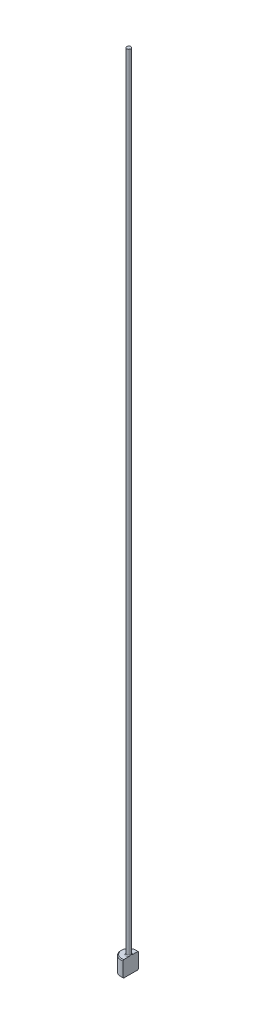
ISO-10303-21;
HEADER;
FILE_DESCRIPTION(('STEP AP214'),'2;1');
FILE_NAME('part.step','',(''),(''),'','','');
FILE_SCHEMA(('AUTOMOTIVE_DESIGN { 1 0 10303 214 1 1 1 1 }'));
ENDSEC;
DATA;
#1=APPLICATION_CONTEXT('core data for automotive mechanical design processes');
#2=APPLICATION_PROTOCOL_DEFINITION('international standard','automotive_design',2000,#1);
#3=PRODUCT_CONTEXT('',#1,'mechanical');
#4=PRODUCT('Part','Part','',(#3));
#5=PRODUCT_RELATED_PRODUCT_CATEGORY('part','',(#4));
#6=PRODUCT_DEFINITION_FORMATION('','',#4);
#7=PRODUCT_DEFINITION_CONTEXT('part definition',#1,'design');
#8=PRODUCT_DEFINITION('design','',#6,#7);
#9=PRODUCT_DEFINITION_SHAPE('','',#8);
#10=(LENGTH_UNIT() NAMED_UNIT(*) SI_UNIT(.MILLI.,.METRE.));
#11=(NAMED_UNIT(*) PLANE_ANGLE_UNIT() SI_UNIT($,.RADIAN.));
#12=(NAMED_UNIT(*) SI_UNIT($,.STERADIAN.) SOLID_ANGLE_UNIT());
#13=UNCERTAINTY_MEASURE_WITH_UNIT(LENGTH_MEASURE(1.E-05),#10,'distance_accuracy_value','');
#14=(GEOMETRIC_REPRESENTATION_CONTEXT(3) GLOBAL_UNCERTAINTY_ASSIGNED_CONTEXT((#13)) GLOBAL_UNIT_ASSIGNED_CONTEXT((#10,
#11,#12)) REPRESENTATION_CONTEXT('',''));
#15=CARTESIAN_POINT('',(0.,0.,0.));
#16=DIRECTION('',(0.,0.,1.));
#17=DIRECTION('',(1.,0.,0.));
#18=AXIS2_PLACEMENT_3D('',#15,#16,#17);
#19=CARTESIAN_POINT('',(0.,0.,0.));
#20=DIRECTION('',(0.,-1.,0.));
#21=DIRECTION('',(0.,0.,-1.));
#22=AXIS2_PLACEMENT_3D('',#19,#20,#21);
#23=PLANE('',#22);
#24=CARTESIAN_POINT('',(0.,0.,0.));
#25=DIRECTION('',(0.,-1.,0.));
#26=DIRECTION('',(0.,0.,-1.));
#27=AXIS2_PLACEMENT_3D('',#24,#25,#26);
#28=CIRCLE('',#27,1.8);
#29=CARTESIAN_POINT('',(0.499999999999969,0.,1.72916164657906));
#30=VERTEX_POINT('',#29);
#31=CARTESIAN_POINT('',(0.499999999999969,0.,-1.72916164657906));
#32=VERTEX_POINT('',#31);
#33=EDGE_CURVE('E98',#30,#32,#28,.T.);
#34=ORIENTED_EDGE('',*,*,#33,.T.);
#35=DIRECTION('',(0.,0.,1.));
#36=VECTOR('',#35,1.);
#37=CARTESIAN_POINT('',(0.499999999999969,0.,1.93649167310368));
#38=LINE('',#37,#36);
#39=EDGE_CURVE('E83',#32,#30,#38,.T.);
#40=ORIENTED_EDGE('',*,*,#39,.T.);
#41=EDGE_LOOP('',(#34,#40));
#42=FACE_BOUND('',#41,.T.);
#43=ADVANCED_FACE('F32',(#42),#23,.T.);
#44=CARTESIAN_POINT('',(0.,259.958771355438,0.));
#45=DIRECTION('',(0.,1.,0.));
#46=DIRECTION('',(0.,0.,1.));
#47=AXIS2_PLACEMENT_3D('',#44,#45,#46);
#48=CYLINDRICAL_SURFACE('',#47,1.99999999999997);
#49=CARTESIAN_POINT('',(0.,3.79999999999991,0.));
#50=DIRECTION('',(0.,1.,0.));
#51=DIRECTION('',(0.,0.,1.));
#52=AXIS2_PLACEMENT_3D('',#49,#50,#51);
#53=CIRCLE('',#52,1.99999999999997);
#54=CARTESIAN_POINT('',(0.499999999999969,3.79999999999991,1.93649167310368));
#55=VERTEX_POINT('',#54);
#56=CARTESIAN_POINT('',(0.499999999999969,3.79999999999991,-1.93649167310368));
#57=VERTEX_POINT('',#56);
#58=EDGE_CURVE('E104',#55,#57,#53,.F.);
#59=ORIENTED_EDGE('',*,*,#58,.T.);
#60=DIRECTION('',(0.,-1.,0.));
#61=VECTOR('',#60,1.);
#62=CARTESIAN_POINT('',(0.499999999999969,200.,-1.93649167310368));
#63=LINE('',#62,#61);
#64=CARTESIAN_POINT('',(0.499999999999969,0.199999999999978,-1.93649167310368));
#65=VERTEX_POINT('',#64);
#66=EDGE_CURVE('E183',#57,#65,#63,.T.);
#67=ORIENTED_EDGE('',*,*,#66,.T.);
#68=CARTESIAN_POINT('',(0.,0.199999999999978,0.));
#69=DIRECTION('',(0.,-1.,0.));
#70=DIRECTION('',(0.,0.,-1.));
#71=AXIS2_PLACEMENT_3D('',#68,#69,#70);
#72=CIRCLE('',#71,1.99999999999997);
#73=CARTESIAN_POINT('',(0.499999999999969,0.199999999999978,1.93649167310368));
#74=VERTEX_POINT('',#73);
#75=EDGE_CURVE('E100',#65,#74,#72,.F.);
#76=ORIENTED_EDGE('',*,*,#75,.T.);
#77=DIRECTION('',(0.,-1.,0.));
#78=VECTOR('',#77,1.);
#79=CARTESIAN_POINT('',(0.499999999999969,200.,1.93649167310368));
#80=LINE('',#79,#78);
#81=EDGE_CURVE('E93',#55,#74,#80,.T.);
#82=ORIENTED_EDGE('',*,*,#81,.F.);
#83=EDGE_LOOP('',(#59,#67,#76,#82));
#84=FACE_BOUND('',#83,.T.);
#85=ADVANCED_FACE('F158',(#84),#48,.T.);
#86=CARTESIAN_POINT('',(-1.99999999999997,4.,0.));
#87=DIRECTION('',(0.,1.,0.));
#88=DIRECTION('',(0.,0.,1.));
#89=AXIS2_PLACEMENT_3D('',#86,#87,#88);
#90=PLANE('',#89);
#91=CARTESIAN_POINT('',(0.,4.,0.));
#92=DIRECTION('',(0.,1.,0.));
#93=DIRECTION('',(0.,0.,1.));
#94=AXIS2_PLACEMENT_3D('',#91,#92,#93);
#95=CIRCLE('',#94,1.79999999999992);
#96=CARTESIAN_POINT('',(0.499999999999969,4.,-1.72916164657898));
#97=VERTEX_POINT('',#96);
#98=CARTESIAN_POINT('',(0.499999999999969,4.,1.72916164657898));
#99=VERTEX_POINT('',#98);
#100=EDGE_CURVE('E178',#97,#99,#95,.T.);
#101=ORIENTED_EDGE('',*,*,#100,.T.);
#102=DIRECTION('',(0.,0.,-1.));
#103=VECTOR('',#102,1.);
#104=CARTESIAN_POINT('',(0.499999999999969,4.,0.));
#105=LINE('',#104,#103);
#106=CARTESIAN_POINT('',(0.499999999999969,3.99999999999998,0.489897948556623));
#107=VERTEX_POINT('',#106);
#108=EDGE_CURVE('E57',#99,#107,#105,.T.);
#109=ORIENTED_EDGE('',*,*,#108,.T.);
#110=CARTESIAN_POINT('',(0.,4.,0.));
#111=DIRECTION('',(0.,1.,0.));
#112=DIRECTION('',(0.,0.,1.));
#113=AXIS2_PLACEMENT_3D('',#110,#111,#112);
#114=CIRCLE('',#113,0.699999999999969);
#115=CARTESIAN_POINT('',(0.499999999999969,3.99999999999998,-0.489897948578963));
#116=VERTEX_POINT('',#115);
#117=EDGE_CURVE('E107',#107,#116,#114,.F.);
#118=ORIENTED_EDGE('',*,*,#117,.T.);
#119=EDGE_CURVE('E136',#116,#97,#105,.T.);
#120=ORIENTED_EDGE('',*,*,#119,.T.);
#121=EDGE_LOOP('',(#101,#109,#118,#120));
#122=FACE_BOUND('',#121,.T.);
#123=ADVANCED_FACE('F147',(#122),#90,.T.);
#124=CARTESIAN_POINT('',(0.,4.,0.));
#125=DIRECTION('',(0.,-1.,0.));
#126=DIRECTION('',(0.,0.,-1.));
#127=AXIS2_PLACEMENT_3D('',#124,#125,#126);
#128=CONICAL_SURFACE('',#127,1.79999999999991,0.785398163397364);
#129=ORIENTED_EDGE('',*,*,#58,.F.);
#130=CARTESIAN_POINT('',(0.499999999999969,1.50720401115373,4.26357800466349));
#131=CARTESIAN_POINT('',(0.499999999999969,1.62013826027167,4.14986755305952));
#132=CARTESIAN_POINT('',(0.499999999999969,1.7330438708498,4.03612863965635));
#133=CARTESIAN_POINT('',(0.499999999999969,1.95879795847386,3.80854889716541));
#134=CARTESIAN_POINT('',(0.499999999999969,2.07164641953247,3.6947080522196));
#135=CARTESIAN_POINT('',(0.499999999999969,2.29770695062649,3.46645461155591));
#136=CARTESIAN_POINT('',(0.499999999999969,2.41091859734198,3.352041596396));
#137=CARTESIAN_POINT('',(0.499999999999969,2.63717793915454,3.12309847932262));
#138=CARTESIAN_POINT('',(0.499999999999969,2.7502256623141,3.0085684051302));
#139=CARTESIAN_POINT('',(0.499999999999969,3.04506948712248,2.70936514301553));
#140=CARTESIAN_POINT('',(0.499999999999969,3.22671512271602,2.52454334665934));
#141=CARTESIAN_POINT('',(0.499999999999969,3.4985530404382,2.2465579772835));
#142=CARTESIAN_POINT('',(0.499999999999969,3.58909436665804,2.15373585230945));
#143=CARTESIAN_POINT('',(0.499999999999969,3.76982478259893,1.96776469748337));
#144=CARTESIAN_POINT('',(0.499999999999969,3.8600139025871,1.87461569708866));
#145=CARTESIAN_POINT('',(0.499999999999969,4.03950849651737,1.68818299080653));
#146=CARTESIAN_POINT('',(0.499999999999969,4.12881605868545,1.59490129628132));
#147=CARTESIAN_POINT('',(0.499999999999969,4.30662189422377,1.40750656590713));
#148=CARTESIAN_POINT('',(0.499999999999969,4.395119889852,1.31339326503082));
#149=CARTESIAN_POINT('',(0.499999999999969,4.52664527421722,1.17121612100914));
#150=CARTESIAN_POINT('',(0.499999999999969,4.57025302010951,1.12368988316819));
#151=CARTESIAN_POINT('',(0.499999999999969,4.65691222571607,1.02813370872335));
#152=CARTESIAN_POINT('',(0.499999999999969,4.69996370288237,0.980103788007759));
#153=CARTESIAN_POINT('',(0.499999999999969,4.78522208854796,0.883344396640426));
#154=CARTESIAN_POINT('',(0.499999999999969,4.82742943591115,0.834615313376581));
#155=CARTESIAN_POINT('',(0.499999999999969,4.91056132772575,0.736078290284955));
#156=CARTESIAN_POINT('',(0.499999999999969,4.95148615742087,0.686270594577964));
#157=CARTESIAN_POINT('',(0.499999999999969,5.00615923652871,0.616697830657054));
#158=CARTESIAN_POINT('',(0.499999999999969,5.02085639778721,0.59767965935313));
#159=CARTESIAN_POINT('',(0.499999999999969,5.04986049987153,0.559345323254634));
#160=CARTESIAN_POINT('',(0.499999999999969,5.06416741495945,0.540029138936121));
#161=CARTESIAN_POINT('',(0.499999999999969,5.09232483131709,0.500987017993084));
#162=CARTESIAN_POINT('',(0.499999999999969,5.10617402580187,0.481260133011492));
#163=CARTESIAN_POINT('',(0.499999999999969,5.13322286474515,0.441366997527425));
#164=CARTESIAN_POINT('',(0.499999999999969,5.14642252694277,0.421200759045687));
#165=CARTESIAN_POINT('',(0.499999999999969,5.18389185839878,0.36131795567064));
#166=CARTESIAN_POINT('',(0.499999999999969,5.20702995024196,0.320875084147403));
#167=CARTESIAN_POINT('',(0.499999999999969,5.24772098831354,0.237332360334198));
#168=CARTESIAN_POINT('',(0.499999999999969,5.26530335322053,0.194247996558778));
#169=CARTESIAN_POINT('',(0.499999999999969,5.28633621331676,0.120860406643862));
#170=CARTESIAN_POINT('',(0.499999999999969,5.29258236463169,0.0913941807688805));
#171=CARTESIAN_POINT('',(0.499999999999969,5.29984670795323,0.0318909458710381));
#172=CARTESIAN_POINT('',(0.499999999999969,5.30088385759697,0.00185640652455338));
#173=CARTESIAN_POINT('',(0.499999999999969,5.29754901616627,-0.0578626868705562));
#174=CARTESIAN_POINT('',(0.499999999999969,5.29318196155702,-0.0875475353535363));
#175=CARTESIAN_POINT('',(0.499999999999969,5.27991452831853,-0.145970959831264));
#176=CARTESIAN_POINT('',(0.499999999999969,5.27099331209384,-0.174704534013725));
#177=CARTESIAN_POINT('',(0.499999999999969,5.24698060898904,-0.238616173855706));
#178=CARTESIAN_POINT('',(0.499999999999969,5.23086745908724,-0.273397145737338));
#179=CARTESIAN_POINT('',(0.499999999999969,5.19533548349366,-0.341256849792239));
#180=CARTESIAN_POINT('',(0.499999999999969,5.17590893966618,-0.374331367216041));
#181=CARTESIAN_POINT('',(0.499999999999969,5.13484403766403,-0.439399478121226));
#182=CARTESIAN_POINT('',(0.499999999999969,5.11319038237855,-0.471383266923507));
#183=CARTESIAN_POINT('',(0.499999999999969,5.06854590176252,-0.534336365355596));
#184=CARTESIAN_POINT('',(0.499999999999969,5.04555662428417,-0.565306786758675));
#185=CARTESIAN_POINT('',(0.499999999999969,4.99582113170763,-0.630230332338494));
#186=CARTESIAN_POINT('',(0.499999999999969,4.96895642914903,-0.664092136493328));
#187=CARTESIAN_POINT('',(0.499999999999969,4.91443104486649,-0.731170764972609));
#188=CARTESIAN_POINT('',(0.499999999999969,4.88677027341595,-0.764387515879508));
#189=CARTESIAN_POINT('',(0.499999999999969,4.80293478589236,-0.863356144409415));
#190=CARTESIAN_POINT('',(0.499999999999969,4.74592734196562,-0.928400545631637));
#191=CARTESIAN_POINT('',(0.499999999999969,4.63061293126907,-1.05749298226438));
#192=CARTESIAN_POINT('',(0.499999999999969,4.57230411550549,-1.12153934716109));
#193=CARTESIAN_POINT('',(0.499999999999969,4.45494129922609,-1.24891760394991));
#194=CARTESIAN_POINT('',(0.499999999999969,4.39588747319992,-1.31224965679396));
#195=CARTESIAN_POINT('',(0.499999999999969,4.27755243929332,-1.43816012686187));
#196=CARTESIAN_POINT('',(0.499999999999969,4.21827347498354,-1.5007406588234));
#197=CARTESIAN_POINT('',(0.499999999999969,4.09936903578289,-1.62557837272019));
#198=CARTESIAN_POINT('',(0.499999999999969,4.03974354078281,-1.68783553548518));
#199=CARTESIAN_POINT('',(0.499999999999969,3.86059814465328,-1.87415457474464));
#200=CARTESIAN_POINT('',(0.499999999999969,3.74071340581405,-1.99786534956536));
#201=CARTESIAN_POINT('',(0.499999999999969,3.44590639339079,-2.30074922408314));
#202=CARTESIAN_POINT('',(0.499999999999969,3.27068324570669,-2.47962880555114));
#203=CARTESIAN_POINT('',(0.499999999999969,2.91959588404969,-2.8368625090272));
#204=CARTESIAN_POINT('',(0.499999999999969,2.74373149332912,-3.0152164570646));
#205=CARTESIAN_POINT('',(0.499999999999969,2.39118783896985,-3.37205745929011));
#206=CARTESIAN_POINT('',(0.499999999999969,2.21450765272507,-3.55054360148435));
#207=CARTESIAN_POINT('',(0.499999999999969,1.86097190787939,-3.90723139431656));
#208=CARTESIAN_POINT('',(0.499999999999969,1.6841164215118,-4.08543311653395));
#209=CARTESIAN_POINT('',(0.499999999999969,1.50720401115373,-4.2635780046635));
#210=B_SPLINE_CURVE_WITH_KNOTS('',3,(#130,#131,#132,#133,#134,#135,#136,#137,#138,#139,#140,
#141,#142,#143,#144,#145,#146,#147,#148,#149,#150,#151,#152,#153,#154,#155,#156,#157,#158,#159,
#160,#161,#162,#163,#164,#165,#166,#167,#168,#169,#170,#171,#172,#173,#174,#175,#176,#177,#178,
#179,#180,#181,#182,#183,#184,#185,#186,#187,#188,#189,#190,#191,#192,#193,#194,#195,#196,#197,
#198,#199,#200,#201,#202,#203,#204,#205,#206,#207,#208,#209),.UNSPECIFIED.,.F.,.F.,(4,2,2,2,2,2,
2,2,2,2,2,2,2,2,2,2,2,2,2,2,2,2,2,2,2,2,2,2,2,2,2,2,2,2,2,2,2,2,2,4),(0.,0.48078884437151,
0.961674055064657,1.44454547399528,1.92732112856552,2.70474283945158,3.09374505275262,
3.48271306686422,3.87013311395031,4.257681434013,4.45118175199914,4.64467598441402,
4.83806685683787,5.03141440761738,5.10351649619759,5.17562332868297,5.24792081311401,
5.32021632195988,5.45980182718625,5.59863530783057,5.68861811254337,5.77827319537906,
5.86784644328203,5.9578332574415,6.07253133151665,6.18750032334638,6.30331969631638,
6.41900742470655,6.54866226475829,6.67833177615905,6.93776961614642,7.19760305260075,
7.4573767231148,7.71597304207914,7.97458452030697,8.4913888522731,9.24259169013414,
9.99402016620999,10.747451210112,11.5006463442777),.UNSPECIFIED.);
#211=EDGE_CURVE('E135',#55,#99,#210,.T.);
#212=ORIENTED_EDGE('',*,*,#211,.T.);
#213=ORIENTED_EDGE('',*,*,#100,.F.);
#214=EDGE_CURVE('E127',#97,#57,#210,.T.);
#215=ORIENTED_EDGE('',*,*,#214,.T.);
#216=EDGE_LOOP('',(#129,#212,#213,#215));
#217=FACE_BOUND('',#216,.T.);
#218=ADVANCED_FACE('F143',(#217),#128,.T.);
#219=CARTESIAN_POINT('',(0.,0.199999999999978,0.));
#220=DIRECTION('',(0.,1.,0.));
#221=DIRECTION('',(0.,0.,1.));
#222=AXIS2_PLACEMENT_3D('',#219,#220,#221);
#223=CONICAL_SURFACE('',#222,1.99999999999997,0.785398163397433);
#224=ORIENTED_EDGE('',*,*,#75,.F.);
#225=CARTESIAN_POINT('',(0.499999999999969,2.49279598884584,-4.26357800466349));
#226=CARTESIAN_POINT('',(0.499999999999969,2.37986173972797,-4.14986755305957));
#227=CARTESIAN_POINT('',(0.499999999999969,2.26695612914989,-4.03612863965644));
#228=CARTESIAN_POINT('',(0.499999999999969,2.04120204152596,-3.80854889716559));
#229=CARTESIAN_POINT('',(0.499999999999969,1.92835358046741,-3.69470805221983));
#230=CARTESIAN_POINT('',(0.499999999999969,1.70229304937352,-3.46645461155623));
#231=CARTESIAN_POINT('',(0.499999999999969,1.58908140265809,-3.35204159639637));
#232=CARTESIAN_POINT('',(0.499999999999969,1.36282206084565,-3.12309847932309));
#233=CARTESIAN_POINT('',(0.499999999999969,1.24977433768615,-3.00856840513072));
#234=CARTESIAN_POINT('',(0.499999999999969,0.9549305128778,-2.70936514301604));
#235=CARTESIAN_POINT('',(0.499999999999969,0.773284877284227,-2.52454334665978));
#236=CARTESIAN_POINT('',(0.499999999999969,0.501446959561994,-2.24655797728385));
#237=CARTESIAN_POINT('',(0.499999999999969,0.410905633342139,-2.15373585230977));
#238=CARTESIAN_POINT('',(0.499999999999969,0.230175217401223,-1.96776469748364));
#239=CARTESIAN_POINT('',(0.499999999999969,0.139986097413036,-1.8746156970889));
#240=CARTESIAN_POINT('',(0.499999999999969,-0.0395084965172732,-1.68818299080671));
#241=CARTESIAN_POINT('',(0.499999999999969,-0.128816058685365,-1.59490129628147));
#242=CARTESIAN_POINT('',(0.499999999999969,-0.306621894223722,-1.40750656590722));
#243=CARTESIAN_POINT('',(0.499999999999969,-0.395119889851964,-1.31339326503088));
#244=CARTESIAN_POINT('',(0.499999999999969,-0.526645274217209,-1.17121612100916));
#245=CARTESIAN_POINT('',(0.499999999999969,-0.570253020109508,-1.12368988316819));
#246=CARTESIAN_POINT('',(0.499999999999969,-0.656912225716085,-1.02813370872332));
#247=CARTESIAN_POINT('',(0.499999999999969,-0.699963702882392,-0.980103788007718));
#248=CARTESIAN_POINT('',(0.499999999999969,-0.785222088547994,-0.883344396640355));
#249=CARTESIAN_POINT('',(0.499999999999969,-0.827429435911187,-0.834615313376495));
#250=CARTESIAN_POINT('',(0.499999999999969,-0.910561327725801,-0.736078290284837));
#251=CARTESIAN_POINT('',(0.499999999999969,-0.951486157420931,-0.68627059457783));
#252=CARTESIAN_POINT('',(0.499999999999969,-1.00615923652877,-0.616697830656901));
#253=CARTESIAN_POINT('',(0.499999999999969,-1.02085639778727,-0.597679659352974));
#254=CARTESIAN_POINT('',(0.499999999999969,-1.04986049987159,-0.559345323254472));
#255=CARTESIAN_POINT('',(0.499999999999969,-1.06416741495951,-0.540029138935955));
#256=CARTESIAN_POINT('',(0.499999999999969,-1.09232483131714,-0.500987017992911));
#257=CARTESIAN_POINT('',(0.499999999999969,-1.10617402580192,-0.481260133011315));
#258=CARTESIAN_POINT('',(0.499999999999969,-1.1332228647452,-0.441366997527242));
#259=CARTESIAN_POINT('',(0.499999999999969,-1.14642252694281,-0.4212007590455));
#260=CARTESIAN_POINT('',(0.499999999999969,-1.18389185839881,-0.361317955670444));
#261=CARTESIAN_POINT('',(0.499999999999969,-1.20702995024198,-0.320875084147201));
#262=CARTESIAN_POINT('',(0.499999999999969,-1.24772098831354,-0.237332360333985));
#263=CARTESIAN_POINT('',(0.499999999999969,-1.26530335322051,-0.194247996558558));
#264=CARTESIAN_POINT('',(0.499999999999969,-1.28633621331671,-0.120860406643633));
#265=CARTESIAN_POINT('',(0.499999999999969,-1.29258236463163,-0.0913941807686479));
#266=CARTESIAN_POINT('',(0.499999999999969,-1.29984670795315,-0.0318909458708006));
#267=CARTESIAN_POINT('',(0.499999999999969,-1.30088385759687,-0.00185640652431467));
#268=CARTESIAN_POINT('',(0.499999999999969,-1.29754901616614,0.0578626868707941));
#269=CARTESIAN_POINT('',(0.499999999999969,-1.29318196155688,0.0875475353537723));
#270=CARTESIAN_POINT('',(0.499999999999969,-1.27991452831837,0.145970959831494));
#271=CARTESIAN_POINT('',(0.499999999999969,-1.27099331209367,0.174704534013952));
#272=CARTESIAN_POINT('',(0.499999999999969,-1.24698060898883,0.23861617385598));
#273=CARTESIAN_POINT('',(0.499999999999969,-1.230867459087,0.273397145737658));
#274=CARTESIAN_POINT('',(0.499999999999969,-1.19533548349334,0.34125684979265));
#275=CARTESIAN_POINT('',(0.499999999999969,-1.17590893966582,0.374331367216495));
#276=CARTESIAN_POINT('',(0.499999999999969,-1.1348440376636,0.439399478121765));
#277=CARTESIAN_POINT('',(0.499999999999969,-1.11319038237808,0.471383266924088));
#278=CARTESIAN_POINT('',(0.499999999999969,-1.06854590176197,0.534336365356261));
#279=CARTESIAN_POINT('',(0.499999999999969,-1.04555662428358,0.56530678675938));
#280=CARTESIAN_POINT('',(0.499999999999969,-0.995821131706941,0.630230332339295));
#281=CARTESIAN_POINT('',(0.499999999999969,-0.968956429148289,0.664092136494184));
#282=CARTESIAN_POINT('',(0.499999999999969,-0.914431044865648,0.731170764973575));
#283=CARTESIAN_POINT('',(0.499999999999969,-0.886770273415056,0.764387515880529));
#284=CARTESIAN_POINT('',(0.499999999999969,-0.802934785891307,0.863356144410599));
#285=CARTESIAN_POINT('',(0.499999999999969,-0.745927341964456,0.92840054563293));
#286=CARTESIAN_POINT('',(0.499999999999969,-0.630612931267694,1.05749298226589));
#287=CARTESIAN_POINT('',(0.499999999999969,-0.572304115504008,1.12153934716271));
#288=CARTESIAN_POINT('',(0.499999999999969,-0.454941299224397,1.24891760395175));
#289=CARTESIAN_POINT('',(0.499999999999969,-0.395887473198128,1.31224965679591));
#290=CARTESIAN_POINT('',(0.499999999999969,-0.277552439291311,1.43816012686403));
#291=CARTESIAN_POINT('',(0.499999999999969,-0.218273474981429,1.50074065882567));
#292=CARTESIAN_POINT('',(0.499999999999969,-0.0993690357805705,1.62557837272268));
#293=CARTESIAN_POINT('',(0.499999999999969,-0.0397435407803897,1.68783553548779));
#294=CARTESIAN_POINT('',(0.499999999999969,0.139401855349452,1.87415457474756));
#295=CARTESIAN_POINT('',(0.499999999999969,0.259286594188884,1.9978653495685));
#296=CARTESIAN_POINT('',(0.499999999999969,0.55409360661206,2.30074922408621));
#297=CARTESIAN_POINT('',(0.499999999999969,0.72931675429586,2.47962880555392));
#298=CARTESIAN_POINT('',(0.499999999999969,1.08040411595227,2.83686250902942));
#299=CARTESIAN_POINT('',(0.499999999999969,1.25626850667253,3.01521645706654));
#300=CARTESIAN_POINT('',(0.499999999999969,1.60881216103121,3.37205745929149));
#301=CARTESIAN_POINT('',(0.499999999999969,1.78549234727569,3.55054360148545));
#302=CARTESIAN_POINT('',(0.499999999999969,2.13902809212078,3.9072313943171));
#303=CARTESIAN_POINT('',(0.499999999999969,2.31588357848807,4.08543311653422));
#304=CARTESIAN_POINT('',(0.499999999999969,2.49279598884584,4.26357800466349));
#305=B_SPLINE_CURVE_WITH_KNOTS('',3,(#225,#226,#227,#228,#229,#230,#231,#232,#233,#234,#235,
#236,#237,#238,#239,#240,#241,#242,#243,#244,#245,#246,#247,#248,#249,#250,#251,#252,#253,#254,
#255,#256,#257,#258,#259,#260,#261,#262,#263,#264,#265,#266,#267,#268,#269,#270,#271,#272,#273,
#274,#275,#276,#277,#278,#279,#280,#281,#282,#283,#284,#285,#286,#287,#288,#289,#290,#291,#292,
#293,#294,#295,#296,#297,#298,#299,#300,#301,#302,#303,#304),.UNSPECIFIED.,.F.,.F.,(4,2,2,2,2,2,
2,2,2,2,2,2,2,2,2,2,2,2,2,2,2,2,2,2,2,2,2,2,2,2,2,2,2,2,2,2,2,2,2,4),(0.,0.480788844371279,
0.961674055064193,1.44454547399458,1.9273211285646,2.70474283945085,3.09374505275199,
3.48271306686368,3.87013311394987,4.25768143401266,4.45118175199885,4.64467598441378,
4.83806685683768,5.03141440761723,5.10351649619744,5.17562332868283,5.24792081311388,
5.32021632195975,5.45980182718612,5.59863530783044,5.68861811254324,5.77827319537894,
5.8678464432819,5.95783325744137,6.0725313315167,6.1875003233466,6.30331969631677,
6.41900742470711,6.54866226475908,6.67833177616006,6.93776961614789,7.19760305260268,
7.45737672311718,7.71597304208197,7.97458452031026,8.49138885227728,9.24259169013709,
9.9940201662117,10.7474512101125,11.500646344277),.UNSPECIFIED.);
#306=EDGE_CURVE('E86',#65,#32,#305,.T.);
#307=ORIENTED_EDGE('',*,*,#306,.T.);
#308=ORIENTED_EDGE('',*,*,#33,.F.);
#309=EDGE_CURVE('E89',#30,#74,#305,.T.);
#310=ORIENTED_EDGE('',*,*,#309,.T.);
#311=EDGE_LOOP('',(#224,#307,#308,#310));
#312=FACE_BOUND('',#311,.T.);
#313=ADVANCED_FACE('F97',(#312),#223,.T.);
#314=CARTESIAN_POINT('',(0.,4.19999999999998,0.));
#315=DIRECTION('',(0.,1.,0.));
#316=DIRECTION('',(0.,0.,1.));
#317=AXIS2_PLACEMENT_3D('',#314,#315,#316);
#318=TOROIDAL_SURFACE('',#317,0.699999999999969,0.2);
#319=CARTESIAN_POINT('',(0.499999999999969,4.19999999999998,0.));
#320=CARTESIAN_POINT('',(0.499999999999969,4.20000053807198,-1.276290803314E-10));
#321=CARTESIAN_POINT('',(0.499999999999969,4.20000107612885,-6.32255682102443E-08));
#322=CARTESIAN_POINT('',(0.499999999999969,4.20000213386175,-2.82964879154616E-07));
#323=CARTESIAN_POINT('',(0.499999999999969,4.2000026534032,-4.40183617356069E-07));
#324=CARTESIAN_POINT('',(0.499999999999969,4.2000036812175,-8.27813239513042E-07));
#325=CARTESIAN_POINT('',(0.499999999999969,4.20000418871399,-1.06023394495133E-06));
#326=CARTESIAN_POINT('',(0.499999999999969,4.20000517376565,-1.57839954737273E-06));
#327=CARTESIAN_POINT('',(0.499999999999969,4.20000565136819,-1.86405706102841E-06));
#328=CARTESIAN_POINT('',(0.499999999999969,4.20000714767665,-2.84099907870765E-06));
#329=CARTESIAN_POINT('',(0.499999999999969,4.20000811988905,-3.60394456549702E-06));
#330=CARTESIAN_POINT('',(0.499999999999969,4.20000994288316,-5.23848834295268E-06));
#331=CARTESIAN_POINT('',(0.499999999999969,4.2000107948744,-6.10880987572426E-06));
#332=CARTESIAN_POINT('',(0.499999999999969,4.20001370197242,-9.26870442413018E-06));
#333=CARTESIAN_POINT('',(0.499999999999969,4.20001560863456,-1.16970153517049E-05));
#334=CARTESIAN_POINT('',(0.499999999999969,4.20001898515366,-1.66756205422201E-05));
#335=CARTESIAN_POINT('',(0.499999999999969,4.20002047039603,-1.92160230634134E-05));
#336=CARTESIAN_POINT('',(0.499999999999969,4.20002619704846,-2.92662000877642E-05));
#337=CARTESIAN_POINT('',(0.499999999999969,4.20003022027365,-3.68956532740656E-05));
#338=CARTESIAN_POINT('',(0.499999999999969,4.20003721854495,-5.16224753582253E-05));
#339=CARTESIAN_POINT('',(0.499999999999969,4.20004025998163,-5.86875950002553E-05));
#340=CARTESIAN_POINT('',(0.499999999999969,4.20006250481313,-0.000106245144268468));
#341=CARTESIAN_POINT('',(0.499999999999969,4.2000886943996,-0.000143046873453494));
#342=CARTESIAN_POINT('',(0.499999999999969,4.20018287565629,-0.00028120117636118));
#343=CARTESIAN_POINT('',(0.499999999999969,4.20024565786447,-0.000385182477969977));
#344=CARTESIAN_POINT('',(0.499999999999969,4.20048281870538,-0.000771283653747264));
#345=CARTESIAN_POINT('',(0.499999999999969,4.20066255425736,-0.00105071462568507));
#346=CARTESIAN_POINT('',(0.499999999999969,4.20136218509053,-0.00214472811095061));
#347=CARTESIAN_POINT('',(0.499999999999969,4.20187621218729,-0.00296224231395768));
#348=CARTESIAN_POINT('',(0.499999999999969,4.21204499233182,-0.0191275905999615));
#349=CARTESIAN_POINT('',(0.499999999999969,4.22176135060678,-0.0344456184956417));
#350=CARTESIAN_POINT('',(0.499999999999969,4.24070578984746,-0.0647500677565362));
#351=CARTESIAN_POINT('',(0.499999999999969,4.24993981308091,-0.0797328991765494));
#352=CARTESIAN_POINT('',(0.499999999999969,4.26897796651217,-0.111312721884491));
#353=CARTESIAN_POINT('',(0.499999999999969,4.27875278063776,-0.127927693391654));
#354=CARTESIAN_POINT('',(0.499999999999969,4.29780667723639,-0.161620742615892));
#355=CARTESIAN_POINT('',(0.499999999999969,4.30708102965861,-0.178701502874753));
#356=CARTESIAN_POINT('',(0.499999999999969,4.32980242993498,-0.222999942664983));
#357=CARTESIAN_POINT('',(0.499999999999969,4.34266834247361,-0.250524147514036));
#358=CARTESIAN_POINT('',(0.499999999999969,4.36514581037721,-0.306264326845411));
#359=CARTESIAN_POINT('',(0.499999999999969,4.37481868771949,-0.33445454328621));
#360=CARTESIAN_POINT('',(0.499999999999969,4.38854584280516,-0.386409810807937));
#361=CARTESIAN_POINT('',(0.499999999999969,4.39332419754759,-0.409978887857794));
#362=CARTESIAN_POINT('',(0.499999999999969,4.39948103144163,-0.458484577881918));
#363=CARTESIAN_POINT('',(0.499999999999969,4.40073041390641,-0.483439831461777));
#364=CARTESIAN_POINT('',(0.499999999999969,4.39878549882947,-0.525361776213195));
#365=CARTESIAN_POINT('',(0.499999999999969,4.39685919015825,-0.542385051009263));
#366=CARTESIAN_POINT('',(0.499999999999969,4.39040994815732,-0.575800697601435));
#367=CARTESIAN_POINT('',(0.499999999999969,4.38591117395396,-0.592197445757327));
#368=CARTESIAN_POINT('',(0.499999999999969,4.37526817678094,-0.620627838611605));
#369=CARTESIAN_POINT('',(0.499999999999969,4.36965917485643,-0.632860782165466));
#370=CARTESIAN_POINT('',(0.499999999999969,4.35652191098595,-0.656281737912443));
#371=CARTESIAN_POINT('',(0.499999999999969,4.34899258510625,-0.667469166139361));
#372=CARTESIAN_POINT('',(0.499999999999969,4.33348787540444,-0.686489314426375));
#373=CARTESIAN_POINT('',(0.499999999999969,4.32581455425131,-0.694567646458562));
#374=CARTESIAN_POINT('',(0.499999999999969,4.3092359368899,-0.7093481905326));
#375=CARTESIAN_POINT('',(0.499999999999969,4.30033137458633,-0.716051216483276));
#376=CARTESIAN_POINT('',(0.499999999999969,4.28139900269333,-0.727801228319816));
#377=CARTESIAN_POINT('',(0.499999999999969,4.27136420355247,-0.732837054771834));
#378=CARTESIAN_POINT('',(0.499999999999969,4.25051406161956,-0.740896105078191));
#379=CARTESIAN_POINT('',(0.499999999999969,4.2396991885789,-0.743920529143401));
#380=CARTESIAN_POINT('',(0.499999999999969,4.2189584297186,-0.747541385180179));
#381=CARTESIAN_POINT('',(0.499999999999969,4.2090739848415,-0.748377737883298));
#382=CARTESIAN_POINT('',(0.499999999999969,4.18931562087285,-0.748281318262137));
#383=CARTESIAN_POINT('',(0.499999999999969,4.17944169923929,-0.747349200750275));
#384=CARTESIAN_POINT('',(0.499999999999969,4.16050847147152,-0.743859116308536));
#385=CARTESIAN_POINT('',(0.499999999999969,4.15143326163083,-0.741386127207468));
#386=CARTESIAN_POINT('',(0.499999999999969,4.13380308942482,-0.73500882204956));
#387=CARTESIAN_POINT('',(0.499999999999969,4.12524816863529,-0.731104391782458));
#388=CARTESIAN_POINT('',(0.499999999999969,4.10851288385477,-0.721844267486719));
#389=CARTESIAN_POINT('',(0.499999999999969,4.10036152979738,-0.716436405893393));
#390=CARTESIAN_POINT('',(0.499999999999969,4.08496509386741,-0.704462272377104));
#391=CARTESIAN_POINT('',(0.499999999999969,4.07772021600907,-0.697895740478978));
#392=CARTESIAN_POINT('',(0.499999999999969,4.06343918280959,-0.683009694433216));
#393=CARTESIAN_POINT('',(0.499999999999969,4.05652301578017,-0.674575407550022));
#394=CARTESIAN_POINT('',(0.499999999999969,4.04395017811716,-0.656812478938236));
#395=CARTESIAN_POINT('',(0.499999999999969,4.03829500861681,-0.64748278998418));
#396=CARTESIAN_POINT('',(0.499999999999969,4.02585782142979,-0.623622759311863));
#397=CARTESIAN_POINT('',(0.499999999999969,4.01980001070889,-0.608712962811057));
#398=CARTESIAN_POINT('',(0.499999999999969,4.01019798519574,-0.57815181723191));
#399=CARTESIAN_POINT('',(0.499999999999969,4.00665175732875,-0.56250107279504));
#400=CARTESIAN_POINT('',(0.499999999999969,4.00085035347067,-0.524814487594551));
#401=CARTESIAN_POINT('',(0.499999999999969,3.99960660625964,-0.502624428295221));
#402=CARTESIAN_POINT('',(0.499999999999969,4.00061484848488,-0.458055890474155));
#403=CARTESIAN_POINT('',(0.499999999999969,4.00291806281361,-0.435679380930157));
#404=CARTESIAN_POINT('',(0.499999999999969,4.01287206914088,-0.37662137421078));
#405=CARTESIAN_POINT('',(0.499999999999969,4.02306808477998,-0.340374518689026));
#406=CARTESIAN_POINT('',(0.499999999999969,4.04187976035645,-0.288479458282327));
#407=CARTESIAN_POINT('',(0.499999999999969,4.04850685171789,-0.272022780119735));
#408=CARTESIAN_POINT('',(0.499999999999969,4.06265559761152,-0.239604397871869));
#409=CARTESIAN_POINT('',(0.499999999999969,4.07017183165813,-0.223640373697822));
#410=CARTESIAN_POINT('',(0.499999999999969,4.08582562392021,-0.19226663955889));
#411=CARTESIAN_POINT('',(0.499999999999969,4.09395460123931,-0.176852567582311));
#412=CARTESIAN_POINT('',(0.499999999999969,4.1109061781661,-0.14601066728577));
#413=CARTESIAN_POINT('',(0.499999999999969,4.11973937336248,-0.130588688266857));
#414=CARTESIAN_POINT('',(0.499999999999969,4.13454771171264,-0.105462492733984));
#415=CARTESIAN_POINT('',(0.499999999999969,4.14041135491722,-0.0956918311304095));
#416=CARTESIAN_POINT('',(0.499999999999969,4.15220833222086,-0.0762990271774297));
#417=CARTESIAN_POINT('',(0.499999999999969,4.15814073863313,-0.0666763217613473));
#418=CARTESIAN_POINT('',(0.499999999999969,4.16956358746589,-0.0482958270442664));
#419=CARTESIAN_POINT('',(0.499999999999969,4.17504841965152,-0.0395344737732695));
#420=CARTESIAN_POINT('',(0.499999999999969,4.18623643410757,-0.0217806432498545));
#421=CARTESIAN_POINT('',(0.499999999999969,4.1919412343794,-0.0127891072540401));
#422=CARTESIAN_POINT('',(0.499999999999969,4.19812331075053,-0.00296314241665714));
#423=CARTESIAN_POINT('',(0.499999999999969,4.19863673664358,-0.00214646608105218));
#424=CARTESIAN_POINT('',(0.499999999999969,4.19933619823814,-0.00105268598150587));
#425=CARTESIAN_POINT('',(0.499999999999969,4.19951633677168,-0.00077263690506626));
#426=CARTESIAN_POINT('',(0.499999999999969,4.199753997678,-0.000385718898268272));
#427=CARTESIAN_POINT('',(0.499999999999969,4.19981689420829,-0.000281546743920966));
#428=CARTESIAN_POINT('',(0.499999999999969,4.1999112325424,-0.000143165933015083));
#429=CARTESIAN_POINT('',(0.499999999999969,4.19993745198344,-0.000106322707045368));
#430=CARTESIAN_POINT('',(0.499999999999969,4.19995971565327,-5.87132323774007E-05));
#431=CARTESIAN_POINT('',(0.499999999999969,4.19996275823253,-5.1643619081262E-05));
#432=CARTESIAN_POINT('',(0.499999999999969,4.19996976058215,-3.69075222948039E-05));
#433=CARTESIAN_POINT('',(0.499999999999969,4.19997378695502,-2.92733864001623E-05));
#434=CARTESIAN_POINT('',(0.499999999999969,4.19997951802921,-1.92179207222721E-05));
#435=CARTESIAN_POINT('',(0.499999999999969,4.19998100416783,-1.66766583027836E-05));
#436=CARTESIAN_POINT('',(0.499999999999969,4.19998438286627,-1.16965321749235E-05));
#437=CARTESIAN_POINT('',(0.499999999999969,4.19998629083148,-9.26757624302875E-06));
#438=CARTESIAN_POINT('',(0.499999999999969,4.19998919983,-6.10711791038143E-06));
#439=CARTESIAN_POINT('',(0.499999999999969,4.19999005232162,-5.23671652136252E-06));
#440=CARTESIAN_POINT('',(0.499999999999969,4.19999187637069,-3.60211739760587E-06));
#441=CARTESIAN_POINT('',(0.499999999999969,4.1999928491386,-2.83919806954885E-06));
#442=CARTESIAN_POINT('',(0.499999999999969,4.19999434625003,-1.86241401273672E-06));
#443=CARTESIAN_POINT('',(0.499999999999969,4.19999482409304,-1.57682668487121E-06));
#444=CARTESIAN_POINT('',(0.499999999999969,4.19999580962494,-1.05884216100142E-06));
#445=CARTESIAN_POINT('',(0.499999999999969,4.19999631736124,-8.26532461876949E-07));
#446=CARTESIAN_POINT('',(0.499999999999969,4.19999734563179,-4.39174206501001E-07));
#447=CARTESIAN_POINT('',(0.499999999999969,4.19999786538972,-2.82113668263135E-07));
#448=CARTESIAN_POINT('',(0.499999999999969,4.19999892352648,-6.27517720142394E-08));
#449=CARTESIAN_POINT('',(0.499999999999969,4.1999994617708,1.27666362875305E-10));
#450=CARTESIAN_POINT('',(0.499999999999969,4.19999999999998,0.));
#451=B_SPLINE_CURVE_WITH_KNOTS('',3,(#319,#320,#321,#322,#323,#324,#325,#326,#327,#328,#329,
#330,#331,#332,#333,#334,#335,#336,#337,#338,#339,#340,#341,#342,#343,#344,#345,#346,#347,#348,
#349,#350,#351,#352,#353,#354,#355,#356,#357,#358,#359,#360,#361,#362,#363,#364,#365,#366,#367,
#368,#369,#370,#371,#372,#373,#374,#375,#376,#377,#378,#379,#380,#381,#382,#383,#384,#385,#386,
#387,#388,#389,#390,#391,#392,#393,#394,#395,#396,#397,#398,#399,#400,#401,#402,#403,#404,#405,
#406,#407,#408,#409,#410,#411,#412,#413,#414,#415,#416,#417,#418,#419,#420,#421,#422,#423,#424,
#425,#426,#427,#428,#429,#430,#431,#432,#433,#434,#435,#436,#437,#438,#439,#440,#441,#442,#443,
#444,#445,#446,#447,#448,#449,#450),.UNSPECIFIED.,.T.,.F.,(4,2,2,2,2,2,2,2,2,2,2,2,2,2,2,2,2,2,
2,2,2,2,2,2,2,2,2,2,2,2,2,2,2,2,2,2,2,2,2,2,2,2,2,2,2,2,2,2,2,2,2,2,2,2,2,2,2,2,2,2,2,2,2,2,2,
4),(0.,1.61264141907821E-06,3.23527813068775E-06,4.9054647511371E-06,6.57293368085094E-06,
1.02633727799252E-05,1.39135331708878E-05,2.31348502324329E-05,3.19553030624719E-05,
5.78146512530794E-05,8.08644760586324E-05,0.000215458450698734,0.000580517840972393,
0.00157645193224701,0.0044742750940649,0.0588833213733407,0.111683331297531,0.169505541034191,
0.22780257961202,0.318834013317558,0.407998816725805,0.479955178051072,0.55451173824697,
0.605741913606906,0.656498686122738,0.696722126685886,0.736967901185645,0.770257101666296,
0.803526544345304,0.837014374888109,0.87048220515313,0.90008770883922,0.929682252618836,
0.957773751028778,0.985867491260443,1.0150939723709,1.04432701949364,1.07692454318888,
1.10956066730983,1.15757154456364,1.20554389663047,1.27185088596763,1.33912449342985,
1.45136032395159,1.50457430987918,1.55747915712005,1.6097463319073,1.66305527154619,
1.69723993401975,1.73115218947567,1.76216312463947,1.79410330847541,1.79699806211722,
1.79799620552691,1.79836193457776,1.79849668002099,1.79851974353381,1.79854561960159,
1.79855444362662,1.79856366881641,1.79856732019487,1.79857101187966,1.79857267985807,
1.79857435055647,1.79857597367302,1.79857758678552),.UNSPECIFIED.);
#452=CARTESIAN_POINT('',(0.499999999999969,4.19999999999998,0.));
#453=VERTEX_POINT('',#452);
#454=EDGE_CURVE('E11',#116,#453,#451,.T.);
#455=ORIENTED_EDGE('',*,*,#454,.F.);
#456=ORIENTED_EDGE('',*,*,#117,.F.);
#457=CARTESIAN_POINT('',(0.499999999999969,4.19999999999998,0.));
#458=CARTESIAN_POINT('',(0.499999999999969,4.19999946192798,1.27629069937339E-10));
#459=CARTESIAN_POINT('',(0.499999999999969,4.19999892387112,6.32255681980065E-08));
#460=CARTESIAN_POINT('',(0.499999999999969,4.19999786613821,2.82964879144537E-07));
#461=CARTESIAN_POINT('',(0.499999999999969,4.19999734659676,4.40183617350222E-07));
#462=CARTESIAN_POINT('',(0.499999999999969,4.19999631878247,8.27813239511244E-07));
#463=CARTESIAN_POINT('',(0.499999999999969,4.19999581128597,1.06023394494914E-06));
#464=CARTESIAN_POINT('',(0.499999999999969,4.19999482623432,1.57839954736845E-06));
#465=CARTESIAN_POINT('',(0.499999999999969,4.19999434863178,1.86405706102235E-06));
#466=CARTESIAN_POINT('',(0.499999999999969,4.19999285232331,2.84099907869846E-06));
#467=CARTESIAN_POINT('',(0.499999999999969,4.19999188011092,3.60394456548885E-06));
#468=CARTESIAN_POINT('',(0.499999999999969,4.19999005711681,5.23848834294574E-06));
#469=CARTESIAN_POINT('',(0.499999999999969,4.19998920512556,6.10880987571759E-06));
#470=CARTESIAN_POINT('',(0.499999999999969,4.19998629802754,9.26870442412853E-06));
#471=CARTESIAN_POINT('',(0.499999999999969,4.1999843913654,1.16970153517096E-05));
#472=CARTESIAN_POINT('',(0.499999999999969,4.1999810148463,1.66756205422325E-05));
#473=CARTESIAN_POINT('',(0.499999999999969,4.19997952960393,1.92160230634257E-05));
#474=CARTESIAN_POINT('',(0.499999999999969,4.1999738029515,2.92662000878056E-05));
#475=CARTESIAN_POINT('',(0.499999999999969,4.19996977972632,3.68956532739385E-05));
#476=CARTESIAN_POINT('',(0.499999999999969,4.19996278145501,5.16224753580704E-05));
#477=CARTESIAN_POINT('',(0.499999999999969,4.19995974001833,5.86875950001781E-05));
#478=CARTESIAN_POINT('',(0.499999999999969,4.19993749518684,0.000106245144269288));
#479=CARTESIAN_POINT('',(0.499999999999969,4.19991130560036,0.000143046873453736));
#480=CARTESIAN_POINT('',(0.499999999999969,4.19981712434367,0.000281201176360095));
#481=CARTESIAN_POINT('',(0.499999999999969,4.19975434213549,0.00038518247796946));
#482=CARTESIAN_POINT('',(0.499999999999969,4.19951718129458,0.000771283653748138));
#483=CARTESIAN_POINT('',(0.499999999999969,4.1993374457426,0.00105071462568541));
#484=CARTESIAN_POINT('',(0.499999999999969,4.19863781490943,0.00214472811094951));
#485=CARTESIAN_POINT('',(0.499999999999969,4.19812378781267,0.00296224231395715));
#486=CARTESIAN_POINT('',(0.499999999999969,4.18795500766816,0.0191275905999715));
#487=CARTESIAN_POINT('',(0.499999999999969,4.17823864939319,0.034445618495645));
#488=CARTESIAN_POINT('',(0.499999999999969,4.1592942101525,0.0647500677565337));
#489=CARTESIAN_POINT('',(0.499999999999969,4.15006018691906,0.0797328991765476));
#490=CARTESIAN_POINT('',(0.499999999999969,4.13102203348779,0.11131272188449));
#491=CARTESIAN_POINT('',(0.499999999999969,4.1212472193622,0.127927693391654));
#492=CARTESIAN_POINT('',(0.499999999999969,4.10219332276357,0.161620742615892));
#493=CARTESIAN_POINT('',(0.499999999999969,4.09291897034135,0.178701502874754));
#494=CARTESIAN_POINT('',(0.499999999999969,4.07019757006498,0.222999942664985));
#495=CARTESIAN_POINT('',(0.499999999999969,4.05733165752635,0.250524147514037));
#496=CARTESIAN_POINT('',(0.499999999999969,4.03485418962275,0.306264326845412));
#497=CARTESIAN_POINT('',(0.499999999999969,4.02518131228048,0.334454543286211));
#498=CARTESIAN_POINT('',(0.499999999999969,4.0114541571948,0.386409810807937));
#499=CARTESIAN_POINT('',(0.499999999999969,4.00667580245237,0.409978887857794));
#500=CARTESIAN_POINT('',(0.499999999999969,4.00051896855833,0.458484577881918));
#501=CARTESIAN_POINT('',(0.499999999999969,3.99926958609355,0.483439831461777));
#502=CARTESIAN_POINT('',(0.499999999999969,4.0012145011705,0.525361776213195));
#503=CARTESIAN_POINT('',(0.499999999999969,4.00314080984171,0.542385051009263));
#504=CARTESIAN_POINT('',(0.499999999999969,4.00959005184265,0.575800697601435));
#505=CARTESIAN_POINT('',(0.499999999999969,4.014088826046,0.592197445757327));
#506=CARTESIAN_POINT('',(0.499999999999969,4.02473182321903,0.620627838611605));
#507=CARTESIAN_POINT('',(0.499999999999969,4.03034082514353,0.632860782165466));
#508=CARTESIAN_POINT('',(0.499999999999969,4.04347808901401,0.656281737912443));
#509=CARTESIAN_POINT('',(0.499999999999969,4.05100741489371,0.667469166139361));
#510=CARTESIAN_POINT('',(0.499999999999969,4.06651212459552,0.686489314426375));
#511=CARTESIAN_POINT('',(0.499999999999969,4.07418544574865,0.694567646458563));
#512=CARTESIAN_POINT('',(0.499999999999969,4.09076406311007,0.7093481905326));
#513=CARTESIAN_POINT('',(0.499999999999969,4.09966862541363,0.716051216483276));
#514=CARTESIAN_POINT('',(0.499999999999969,4.11860099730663,0.727801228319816));
#515=CARTESIAN_POINT('',(0.499999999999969,4.12863579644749,0.732837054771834));
#516=CARTESIAN_POINT('',(0.499999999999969,4.14948593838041,0.740896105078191));
#517=CARTESIAN_POINT('',(0.499999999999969,4.16030081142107,0.743920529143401));
#518=CARTESIAN_POINT('',(0.499999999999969,4.18104157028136,0.747541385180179));
#519=CARTESIAN_POINT('',(0.499999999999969,4.19092601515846,0.748377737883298));
#520=CARTESIAN_POINT('',(0.499999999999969,4.21068437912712,0.748281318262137));
#521=CARTESIAN_POINT('',(0.499999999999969,4.22055830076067,0.747349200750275));
#522=CARTESIAN_POINT('',(0.499999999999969,4.23949152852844,0.743859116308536));
#523=CARTESIAN_POINT('',(0.499999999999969,4.24856673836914,0.741386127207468));
#524=CARTESIAN_POINT('',(0.499999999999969,4.26619691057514,0.73500882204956));
#525=CARTESIAN_POINT('',(0.499999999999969,4.27475183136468,0.731104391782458));
#526=CARTESIAN_POINT('',(0.499999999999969,4.29148711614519,0.721844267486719));
#527=CARTESIAN_POINT('',(0.499999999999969,4.29963847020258,0.716436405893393));
#528=CARTESIAN_POINT('',(0.499999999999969,4.31503490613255,0.704462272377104));
#529=CARTESIAN_POINT('',(0.499999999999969,4.3222797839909,0.697895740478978));
#530=CARTESIAN_POINT('',(0.499999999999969,4.33656081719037,0.683009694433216));
#531=CARTESIAN_POINT('',(0.499999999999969,4.34347698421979,0.674575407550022));
#532=CARTESIAN_POINT('',(0.499999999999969,4.3560498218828,0.656812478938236));
#533=CARTESIAN_POINT('',(0.499999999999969,4.36170499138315,0.64748278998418));
#534=CARTESIAN_POINT('',(0.499999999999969,4.37414217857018,0.623622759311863));
#535=CARTESIAN_POINT('',(0.499999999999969,4.38019998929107,0.608712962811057));
#536=CARTESIAN_POINT('',(0.499999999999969,4.38980201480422,0.57815181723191));
#537=CARTESIAN_POINT('',(0.499999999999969,4.39334824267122,0.56250107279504));
#538=CARTESIAN_POINT('',(0.499999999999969,4.39914964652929,0.524814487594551));
#539=CARTESIAN_POINT('',(0.499999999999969,4.40039339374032,0.502624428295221));
#540=CARTESIAN_POINT('',(0.499999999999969,4.39938515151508,0.458055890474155));
#541=CARTESIAN_POINT('',(0.499999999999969,4.39708193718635,0.435679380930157));
#542=CARTESIAN_POINT('',(0.499999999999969,4.38712793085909,0.37662137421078));
#543=CARTESIAN_POINT('',(0.499999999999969,4.37693191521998,0.340374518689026));
#544=CARTESIAN_POINT('',(0.499999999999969,4.35812023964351,0.288479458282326));
#545=CARTESIAN_POINT('',(0.499999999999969,4.35149314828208,0.272022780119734));
#546=CARTESIAN_POINT('',(0.499999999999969,4.33734440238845,0.239604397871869));
#547=CARTESIAN_POINT('',(0.499999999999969,4.32982816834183,0.223640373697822));
#548=CARTESIAN_POINT('',(0.499999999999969,4.31417437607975,0.19226663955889));
#549=CARTESIAN_POINT('',(0.499999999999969,4.30604539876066,0.176852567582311));
#550=CARTESIAN_POINT('',(0.499999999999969,4.28909382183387,0.14601066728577));
#551=CARTESIAN_POINT('',(0.499999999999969,4.28026062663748,0.130588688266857));
#552=CARTESIAN_POINT('',(0.499999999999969,4.26545228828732,0.105462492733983));
#553=CARTESIAN_POINT('',(0.499999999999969,4.25958864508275,0.095691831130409));
#554=CARTESIAN_POINT('',(0.499999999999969,4.2477916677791,0.0762990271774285));
#555=CARTESIAN_POINT('',(0.499999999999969,4.24185926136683,0.0666763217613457));
#556=CARTESIAN_POINT('',(0.499999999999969,4.23043641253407,0.0482958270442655));
#557=CARTESIAN_POINT('',(0.499999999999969,4.22495158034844,0.0395344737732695));
#558=CARTESIAN_POINT('',(0.499999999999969,4.21376356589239,0.021780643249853));
#559=CARTESIAN_POINT('',(0.499999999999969,4.20805876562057,0.0127891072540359));
#560=CARTESIAN_POINT('',(0.499999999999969,4.20187668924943,0.00296314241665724));
#561=CARTESIAN_POINT('',(0.499999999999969,4.20136326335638,0.00214646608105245));
#562=CARTESIAN_POINT('',(0.499999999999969,4.20066380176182,0.00105268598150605));
#563=CARTESIAN_POINT('',(0.499999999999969,4.20048366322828,0.000772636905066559));
#564=CARTESIAN_POINT('',(0.499999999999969,4.20024600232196,0.000385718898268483));
#565=CARTESIAN_POINT('',(0.499999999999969,4.20018310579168,0.000281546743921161));
#566=CARTESIAN_POINT('',(0.499999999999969,4.20008876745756,0.000143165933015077));
#567=CARTESIAN_POINT('',(0.499999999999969,4.20006254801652,0.000106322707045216));
#568=CARTESIAN_POINT('',(0.499999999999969,4.2000402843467,5.87132323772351E-05));
#569=CARTESIAN_POINT('',(0.499999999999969,4.20003724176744,5.16436190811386E-05));
#570=CARTESIAN_POINT('',(0.499999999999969,4.20003023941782,3.69075222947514E-05));
#571=CARTESIAN_POINT('',(0.499999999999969,4.20002621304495,2.92733864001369E-05));
#572=CARTESIAN_POINT('',(0.499999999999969,4.20002048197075,1.92179207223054E-05));
#573=CARTESIAN_POINT('',(0.499999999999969,4.20001899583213,1.66766583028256E-05));
#574=CARTESIAN_POINT('',(0.499999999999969,4.2000156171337,1.16965321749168E-05));
#575=CARTESIAN_POINT('',(0.499999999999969,4.20001370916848,9.26757624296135E-06));
#576=CARTESIAN_POINT('',(0.499999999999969,4.20001080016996,6.10711791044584E-06));
#577=CARTESIAN_POINT('',(0.499999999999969,4.20000994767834,5.2367165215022E-06));
#578=CARTESIAN_POINT('',(0.499999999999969,4.20000812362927,3.60211739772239E-06));
#579=CARTESIAN_POINT('',(0.499999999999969,4.20000715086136,2.83919806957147E-06));
#580=CARTESIAN_POINT('',(0.499999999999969,4.20000565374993,1.86241401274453E-06));
#581=CARTESIAN_POINT('',(0.499999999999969,4.20000517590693,1.57682668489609E-06));
#582=CARTESIAN_POINT('',(0.499999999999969,4.20000419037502,1.05884216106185E-06));
#583=CARTESIAN_POINT('',(0.499999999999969,4.20000368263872,8.26532461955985E-07));
#584=CARTESIAN_POINT('',(0.499999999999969,4.20000265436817,4.39174206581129E-07));
#585=CARTESIAN_POINT('',(0.499999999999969,4.20000213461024,2.82113668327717E-07));
#586=CARTESIAN_POINT('',(0.499999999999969,4.20000107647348,6.2751772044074E-08));
#587=CARTESIAN_POINT('',(0.499999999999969,4.20000053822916,-1.276663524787E-10));
#588=CARTESIAN_POINT('',(0.499999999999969,4.19999999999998,0.));
#589=B_SPLINE_CURVE_WITH_KNOTS('',3,(#457,#458,#459,#460,#461,#462,#463,#464,#465,#466,#467,
#468,#469,#470,#471,#472,#473,#474,#475,#476,#477,#478,#479,#480,#481,#482,#483,#484,#485,#486,
#487,#488,#489,#490,#491,#492,#493,#494,#495,#496,#497,#498,#499,#500,#501,#502,#503,#504,#505,
#506,#507,#508,#509,#510,#511,#512,#513,#514,#515,#516,#517,#518,#519,#520,#521,#522,#523,#524,
#525,#526,#527,#528,#529,#530,#531,#532,#533,#534,#535,#536,#537,#538,#539,#540,#541,#542,#543,
#544,#545,#546,#547,#548,#549,#550,#551,#552,#553,#554,#555,#556,#557,#558,#559,#560,#561,#562,
#563,#564,#565,#566,#567,#568,#569,#570,#571,#572,#573,#574,#575,#576,#577,#578,#579,#580,#581,
#582,#583,#584,#585,#586,#587,#588),.UNSPECIFIED.,.T.,.F.,(4,2,2,2,2,2,2,2,2,2,2,2,2,2,2,2,2,2,
2,2,2,2,2,2,2,2,2,2,2,2,2,2,2,2,2,2,2,2,2,2,2,2,2,2,2,2,2,2,2,2,2,2,2,2,2,2,2,2,2,2,2,2,2,2,2,
4),(0.,1.61264141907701E-06,3.23527813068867E-06,4.90546475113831E-06,6.57293368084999E-06,
1.0263372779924E-05,1.39135331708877E-05,2.31348502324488E-05,3.19553030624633E-05,
5.78146512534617E-05,8.08644760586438E-05,0.000215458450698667,0.000580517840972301,
0.00157645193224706,0.00447427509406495,0.0588833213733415,0.111683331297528,0.169505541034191,
0.227802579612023,0.31883401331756,0.407998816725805,0.479955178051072,0.55451173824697,
0.605741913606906,0.656498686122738,0.696722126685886,0.736967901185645,0.770257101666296,
0.803526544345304,0.837014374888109,0.87048220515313,0.90008770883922,0.929682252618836,
0.957773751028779,0.985867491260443,1.0150939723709,1.04432701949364,1.07692454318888,
1.10956066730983,1.15757154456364,1.20554389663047,1.27185088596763,1.33912449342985,
1.45136032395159,1.50457430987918,1.55747915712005,1.6097463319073,1.66305527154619,
1.69723993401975,1.73115218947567,1.76216312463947,1.79410330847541,1.79699806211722,
1.79799620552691,1.79836193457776,1.79849668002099,1.79851974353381,1.79854561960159,
1.79855444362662,1.79856366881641,1.79856732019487,1.79857101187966,1.79857267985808,
1.79857435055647,1.79857597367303,1.79857758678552),.UNSPECIFIED.);
#590=EDGE_CURVE('E46',#453,#107,#589,.T.);
#591=ORIENTED_EDGE('',*,*,#590,.F.);
#592=CARTESIAN_POINT('',(0.,4.19999999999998,0.));
#593=DIRECTION('',(0.,1.,0.));
#594=DIRECTION('',(0.,0.,1.));
#595=AXIS2_PLACEMENT_3D('',#592,#593,#594);
#596=CIRCLE('',#595,0.499999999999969);
#597=EDGE_CURVE('E103',#453,#453,#596,.T.);
#598=ORIENTED_EDGE('',*,*,#597,.F.);
#599=EDGE_LOOP('',(#455,#456,#591,#598));
#600=FACE_BOUND('',#599,.T.);
#601=ADVANCED_FACE('F34',(#600),#318,.F.);
#602=CARTESIAN_POINT('',(0.,259.958771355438,0.));
#603=DIRECTION('',(0.,1.,0.));
#604=DIRECTION('',(0.,0.,1.));
#605=AXIS2_PLACEMENT_3D('',#602,#603,#604);
#606=CYLINDRICAL_SURFACE('',#605,0.499999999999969);
#607=ORIENTED_EDGE('',*,*,#597,.T.);
#608=EDGE_LOOP('',(#607));
#609=FACE_BOUND('',#608,.T.);
#610=CARTESIAN_POINT('',(0.,200.,0.));
#611=DIRECTION('',(0.,1.,0.));
#612=DIRECTION('',(0.,0.,1.));
#613=AXIS2_PLACEMENT_3D('',#610,#611,#612);
#614=CIRCLE('',#613,0.499999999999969);
#615=CARTESIAN_POINT('',(0.,200.,0.499999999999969));
#616=VERTEX_POINT('',#615);
#617=EDGE_CURVE('E101',#616,#616,#614,.T.);
#618=ORIENTED_EDGE('',*,*,#617,.F.);
#619=EDGE_LOOP('',(#618));
#620=FACE_BOUND('',#619,.T.);
#621=ADVANCED_FACE('F155',(#609,#620),#606,.T.);
#622=CARTESIAN_POINT('',(-0.499999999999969,200.,0.));
#623=DIRECTION('',(0.,1.,0.));
#624=DIRECTION('',(0.,0.,1.));
#625=AXIS2_PLACEMENT_3D('',#622,#623,#624);
#626=PLANE('',#625);
#627=ORIENTED_EDGE('',*,*,#617,.T.);
#628=EDGE_LOOP('',(#627));
#629=FACE_BOUND('',#628,.T.);
#630=ADVANCED_FACE('F121',(#629),#626,.T.);
#631=CARTESIAN_POINT('',(0.499999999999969,200.,1.93649167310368));
#632=DIRECTION('',(1.,0.,0.));
#633=DIRECTION('',(0.,0.,-1.));
#634=AXIS2_PLACEMENT_3D('',#631,#632,#633);
#635=PLANE('',#634);
#636=ORIENTED_EDGE('',*,*,#66,.F.);
#637=ORIENTED_EDGE('',*,*,#214,.F.);
#638=ORIENTED_EDGE('',*,*,#119,.F.);
#639=ORIENTED_EDGE('',*,*,#454,.T.);
#640=ORIENTED_EDGE('',*,*,#590,.T.);
#641=ORIENTED_EDGE('',*,*,#108,.F.);
#642=ORIENTED_EDGE('',*,*,#211,.F.);
#643=ORIENTED_EDGE('',*,*,#81,.T.);
#644=ORIENTED_EDGE('',*,*,#309,.F.);
#645=ORIENTED_EDGE('',*,*,#39,.F.);
#646=ORIENTED_EDGE('',*,*,#306,.F.);
#647=EDGE_LOOP('',(#636,#637,#638,#639,#640,#641,#642,#643,#644,#645,#646));
#648=FACE_BOUND('',#647,.T.);
#649=ADVANCED_FACE('F85',(#648),#635,.T.);
#650=CLOSED_SHELL('',(#43,#85,#123,#218,#313,#601,#621,#630,#649));
#651=MANIFOLD_SOLID_BREP('B2',#650);
#652=ADVANCED_BREP_SHAPE_REPRESENTATION('',(#18,#651),#14);
#653=SHAPE_DEFINITION_REPRESENTATION(#9,#652);
ENDSEC;
END-ISO-10303-21;
